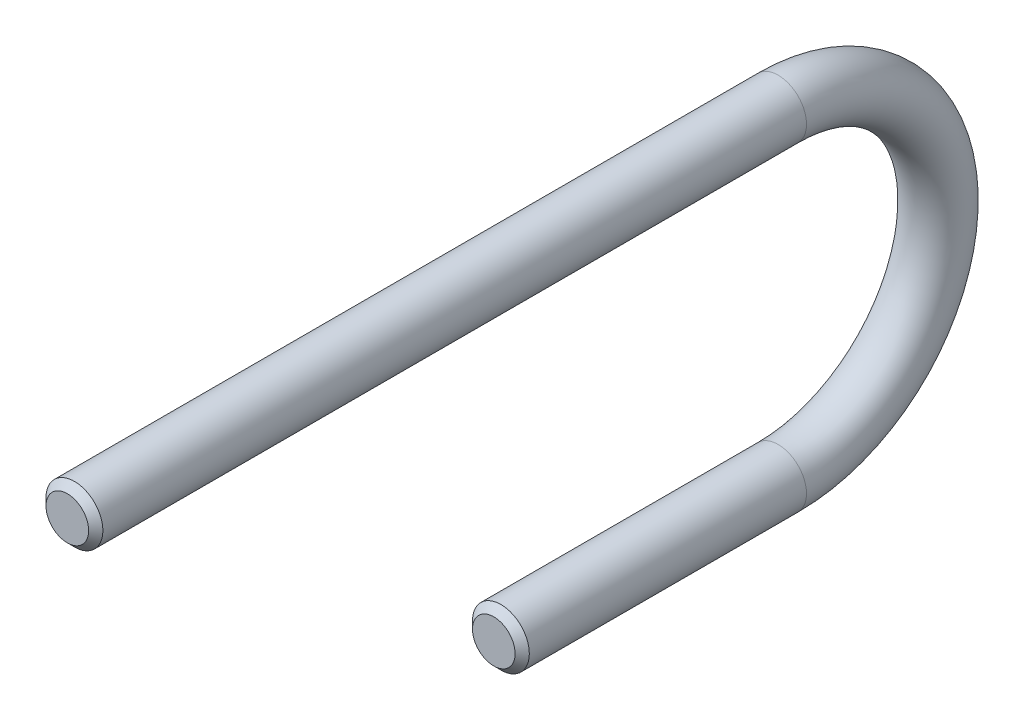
ISO-10303-21;
HEADER;
FILE_DESCRIPTION(('STEP AP214'),'2;1');
FILE_NAME('part.step','',(''),(''),'','','');
FILE_SCHEMA(('AUTOMOTIVE_DESIGN { 1 0 10303 214 1 1 1 1 }'));
ENDSEC;
DATA;
#1=APPLICATION_CONTEXT('core data for automotive mechanical design processes');
#2=APPLICATION_PROTOCOL_DEFINITION('international standard','automotive_design',2000,#1);
#3=PRODUCT_CONTEXT('',#1,'mechanical');
#4=PRODUCT('Part','Part','',(#3));
#5=PRODUCT_RELATED_PRODUCT_CATEGORY('part','',(#4));
#6=PRODUCT_DEFINITION_FORMATION('','',#4);
#7=PRODUCT_DEFINITION_CONTEXT('part definition',#1,'design');
#8=PRODUCT_DEFINITION('design','',#6,#7);
#9=PRODUCT_DEFINITION_SHAPE('','',#8);
#10=(LENGTH_UNIT() NAMED_UNIT(*) SI_UNIT(.MILLI.,.METRE.));
#11=(NAMED_UNIT(*) PLANE_ANGLE_UNIT() SI_UNIT($,.RADIAN.));
#12=(NAMED_UNIT(*) SI_UNIT($,.STERADIAN.) SOLID_ANGLE_UNIT());
#13=UNCERTAINTY_MEASURE_WITH_UNIT(LENGTH_MEASURE(1.E-05),#10,'distance_accuracy_value','');
#14=(GEOMETRIC_REPRESENTATION_CONTEXT(3) GLOBAL_UNCERTAINTY_ASSIGNED_CONTEXT((#13)) GLOBAL_UNIT_ASSIGNED_CONTEXT((#10,
#11,#12)) REPRESENTATION_CONTEXT('',''));
#15=CARTESIAN_POINT('',(0.,0.,0.));
#16=DIRECTION('',(0.,0.,1.));
#17=DIRECTION('',(1.,0.,0.));
#18=AXIS2_PLACEMENT_3D('',#15,#16,#17);
#19=CARTESIAN_POINT('',(0.,0.,0.));
#20=DIRECTION('',(0.,0.,1.));
#21=DIRECTION('',(1.,0.,0.));
#22=AXIS2_PLACEMENT_3D('',#19,#20,#21);
#23=PLANE('',#22);
#24=CARTESIAN_POINT('',(0.,0.,0.));
#25=DIRECTION('',(0.,0.,1.));
#26=DIRECTION('',(1.,0.,0.));
#27=AXIS2_PLACEMENT_3D('',#24,#25,#26);
#28=CIRCLE('',#27,3.);
#29=CARTESIAN_POINT('',(3.,0.,0.));
#30=VERTEX_POINT('',#29);
#31=EDGE_CURVE('E55',#30,#30,#28,.T.);
#32=ORIENTED_EDGE('',*,*,#31,.T.);
#33=EDGE_LOOP('',(#32));
#34=FACE_BOUND('',#33,.T.);
#35=ADVANCED_FACE('F39',(#34),#23,.T.);
#36=CARTESIAN_POINT('',(0.,45.,60.));
#37=DIRECTION('',(0.,0.,-1.));
#38=DIRECTION('',(1.,0.,0.));
#39=AXIS2_PLACEMENT_3D('',#36,#37,#38);
#40=PLANE('',#39);
#41=CARTESIAN_POINT('',(0.,45.,60.));
#42=DIRECTION('',(0.,0.,-1.));
#43=DIRECTION('',(0.,1.,0.));
#44=AXIS2_PLACEMENT_3D('',#41,#42,#43);
#45=CIRCLE('',#44,3.00000000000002);
#46=CARTESIAN_POINT('',(0.,48.,60.));
#47=VERTEX_POINT('',#46);
#48=EDGE_CURVE('E10',#47,#47,#45,.F.);
#49=ORIENTED_EDGE('',*,*,#48,.T.);
#50=EDGE_LOOP('',(#49));
#51=FACE_BOUND('',#50,.T.);
#52=ADVANCED_FACE('F81',(#51),#40,.F.);
#53=CARTESIAN_POINT('',(0.,0.,0.));
#54=DIRECTION('',(0.,0.,-1.));
#55=DIRECTION('',(-1.,0.,0.));
#56=AXIS2_PLACEMENT_3D('',#53,#54,#55);
#57=CYLINDRICAL_SURFACE('',#56,4.);
#58=CARTESIAN_POINT('',(0.,0.,-0.999999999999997));
#59=DIRECTION('',(0.,0.,1.));
#60=DIRECTION('',(1.,0.,0.));
#61=AXIS2_PLACEMENT_3D('',#58,#59,#60);
#62=CIRCLE('',#61,4.);
#63=CARTESIAN_POINT('',(4.,0.,-0.999999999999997));
#64=VERTEX_POINT('',#63);
#65=EDGE_CURVE('E51',#64,#64,#62,.F.);
#66=ORIENTED_EDGE('',*,*,#65,.T.);
#67=EDGE_LOOP('',(#66));
#68=FACE_BOUND('',#67,.T.);
#69=CARTESIAN_POINT('',(0.,0.,-40.));
#70=DIRECTION('',(0.,0.,1.));
#71=DIRECTION('',(1.,0.,0.));
#72=AXIS2_PLACEMENT_3D('',#69,#70,#71);
#73=CIRCLE('',#72,4.);
#74=CARTESIAN_POINT('',(0.,-4.,-40.));
#75=VERTEX_POINT('',#74);
#76=EDGE_CURVE('E63',#75,#75,#73,.T.);
#77=ORIENTED_EDGE('',*,*,#76,.T.);
#78=EDGE_LOOP('',(#77));
#79=FACE_BOUND('',#78,.T.);
#80=ADVANCED_FACE('F67',(#68,#79),#57,.T.);
#81=CARTESIAN_POINT('',(0.,22.5,-40.));
#82=DIRECTION('',(1.,0.,0.));
#83=DIRECTION('',(0.,0.,-1.));
#84=AXIS2_PLACEMENT_3D('',#81,#82,#83);
#85=TOROIDAL_SURFACE('',#84,22.5,4.);
#86=CARTESIAN_POINT('',(0.,45.,-40.));
#87=DIRECTION('',(0.,0.,-1.));
#88=DIRECTION('',(1.,0.,0.));
#89=AXIS2_PLACEMENT_3D('',#86,#87,#88);
#90=CIRCLE('',#89,4.);
#91=CARTESIAN_POINT('',(0.,49.,-40.));
#92=VERTEX_POINT('',#91);
#93=EDGE_CURVE('E60',#92,#92,#90,.T.);
#94=CARTESIAN_POINT('',(0.,22.5,-40.));
#95=DIRECTION('',(1.,0.,0.));
#96=DIRECTION('',(0.,0.,-1.));
#97=AXIS2_PLACEMENT_3D('',#94,#95,#96);
#98=CIRCLE('',#97,26.5);
#99=EDGE_CURVE('',#75,#92,#98,.T.);
#100=ORIENTED_EDGE('',*,*,#76,.F.);
#101=ORIENTED_EDGE('',*,*,#93,.T.);
#102=ORIENTED_EDGE('',*,*,#99,.T.);
#103=ORIENTED_EDGE('',*,*,#99,.F.);
#104=EDGE_LOOP('',(#100,#102,#101,#103));
#105=FACE_BOUND('',#104,.T.);
#106=ADVANCED_FACE('F69',(#105),#85,.T.);
#107=CARTESIAN_POINT('',(0.,45.,-40.));
#108=DIRECTION('',(0.,0.,1.));
#109=DIRECTION('',(0.,-1.,0.));
#110=AXIS2_PLACEMENT_3D('',#107,#108,#109);
#111=CYLINDRICAL_SURFACE('',#110,4.);
#112=CARTESIAN_POINT('',(0.,45.,59.));
#113=DIRECTION('',(0.,0.,-1.));
#114=DIRECTION('',(-1.,0.,0.));
#115=AXIS2_PLACEMENT_3D('',#112,#113,#114);
#116=CIRCLE('',#115,4.);
#117=CARTESIAN_POINT('',(-4.,45.,59.));
#118=VERTEX_POINT('',#117);
#119=EDGE_CURVE('E47',#118,#118,#116,.T.);
#120=ORIENTED_EDGE('',*,*,#119,.T.);
#121=EDGE_LOOP('',(#120));
#122=FACE_BOUND('',#121,.T.);
#123=ORIENTED_EDGE('',*,*,#93,.F.);
#124=EDGE_LOOP('',(#123));
#125=FACE_BOUND('',#124,.T.);
#126=ADVANCED_FACE('F71',(#122,#125),#111,.T.);
#127=CARTESIAN_POINT('',(0.,0.,0.));
#128=DIRECTION('',(0.,0.,-1.));
#129=DIRECTION('',(-1.,0.,0.));
#130=AXIS2_PLACEMENT_3D('',#127,#128,#129);
#131=CONICAL_SURFACE('',#130,3.,0.785398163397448);
#132=ORIENTED_EDGE('',*,*,#65,.F.);
#133=EDGE_LOOP('',(#132));
#134=FACE_BOUND('',#133,.T.);
#135=ORIENTED_EDGE('',*,*,#31,.F.);
#136=EDGE_LOOP('',(#135));
#137=FACE_BOUND('',#136,.T.);
#138=ADVANCED_FACE('F78',(#134,#137),#131,.T.);
#139=CARTESIAN_POINT('',(0.,45.,59.));
#140=DIRECTION('',(0.,0.,-1.));
#141=DIRECTION('',(-1.,0.,0.));
#142=AXIS2_PLACEMENT_3D('',#139,#140,#141);
#143=CONICAL_SURFACE('',#142,4.,0.785398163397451);
#144=ORIENTED_EDGE('',*,*,#48,.F.);
#145=EDGE_LOOP('',(#144));
#146=FACE_BOUND('',#145,.T.);
#147=ORIENTED_EDGE('',*,*,#119,.F.);
#148=EDGE_LOOP('',(#147));
#149=FACE_BOUND('',#148,.T.);
#150=ADVANCED_FACE('F42',(#146,#149),#143,.T.);
#151=CLOSED_SHELL('',(#35,#52,#80,#106,#126,#138,#150));
#152=MANIFOLD_SOLID_BREP('B2',#151);
#153=ADVANCED_BREP_SHAPE_REPRESENTATION('',(#18,#152),#14);
#154=SHAPE_DEFINITION_REPRESENTATION(#9,#153);
ENDSEC;
END-ISO-10303-21;
